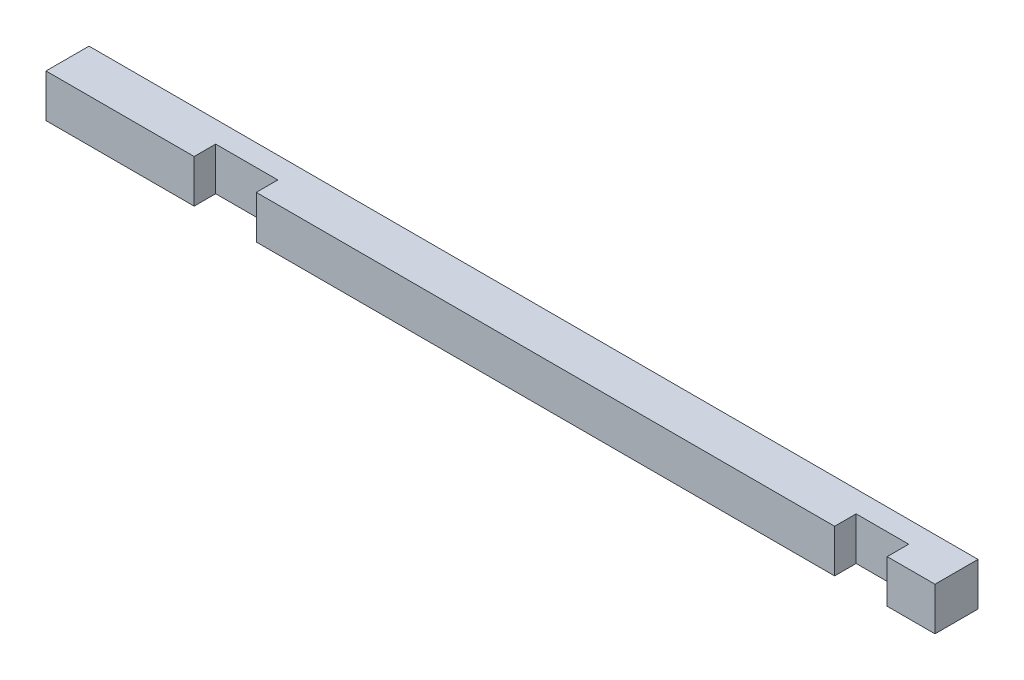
from build123d import *

# Parameters (mm, degrees)
ESQUISSE1_W             = 186
ESQUISSE1_H             = 9
EXTRUSION1_DEPTH        = 9
ESQUISSE2_W             = 13
ESQUISSE2_H             = 9
ESQUISSE2_W_2           = 11
ENL_V_MAT_EXTRU_1_DEPTH = 4.5


with BuildPart() as part:
    # Esquisse1 → Extrusion1 (new body)
    with BuildSketch(Plane.XY):
        with Locations((93, 4.5)):
            Rectangle(ESQUISSE1_W, ESQUISSE1_H)
    extrude(amount=EXTRUSION1_DEPTH)

    # Esquisse2 → Enl_v. mat.-Extru.1 (cut)
    with BuildSketch(Plane.XY.offset(9)):
        with Locations((37.5, 4.5)):
            Rectangle(ESQUISSE2_W, ESQUISSE2_H)
        with Locations((170.5, 4.5)):
            Rectangle(ESQUISSE2_W_2, ESQUISSE2_H)
    extrude(amount=-ENL_V_MAT_EXTRU_1_DEPTH, mode=Mode.SUBTRACT)


solid = part.part
